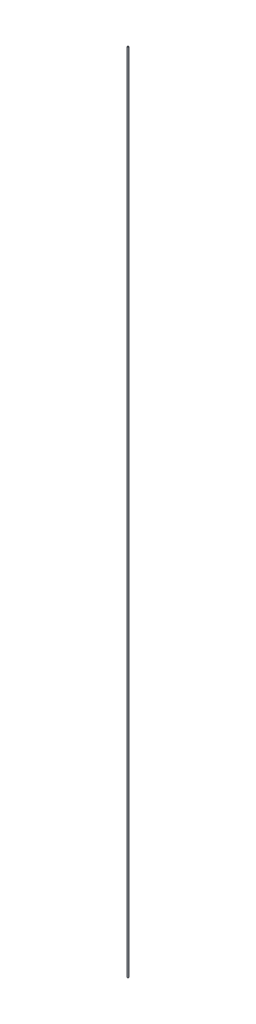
from build123d import *

# Parameters (mm, degrees)
ESQUISSE1_R      = 1.5
EXTRUSION1_DEPTH = 1980


with BuildPart() as part:
    # Esquisse1 → Extrusion1 (new body)
    with BuildSketch(Plane(origin=(0, 0, 0), x_dir=(1, 0, 0), z_dir=(0, 1, 0))):
        with Locations(Location((0, 0, 0), (0, 0, 270))):
            Circle(ESQUISSE1_R)
    extrude(amount=EXTRUSION1_DEPTH)


solid = part.part
